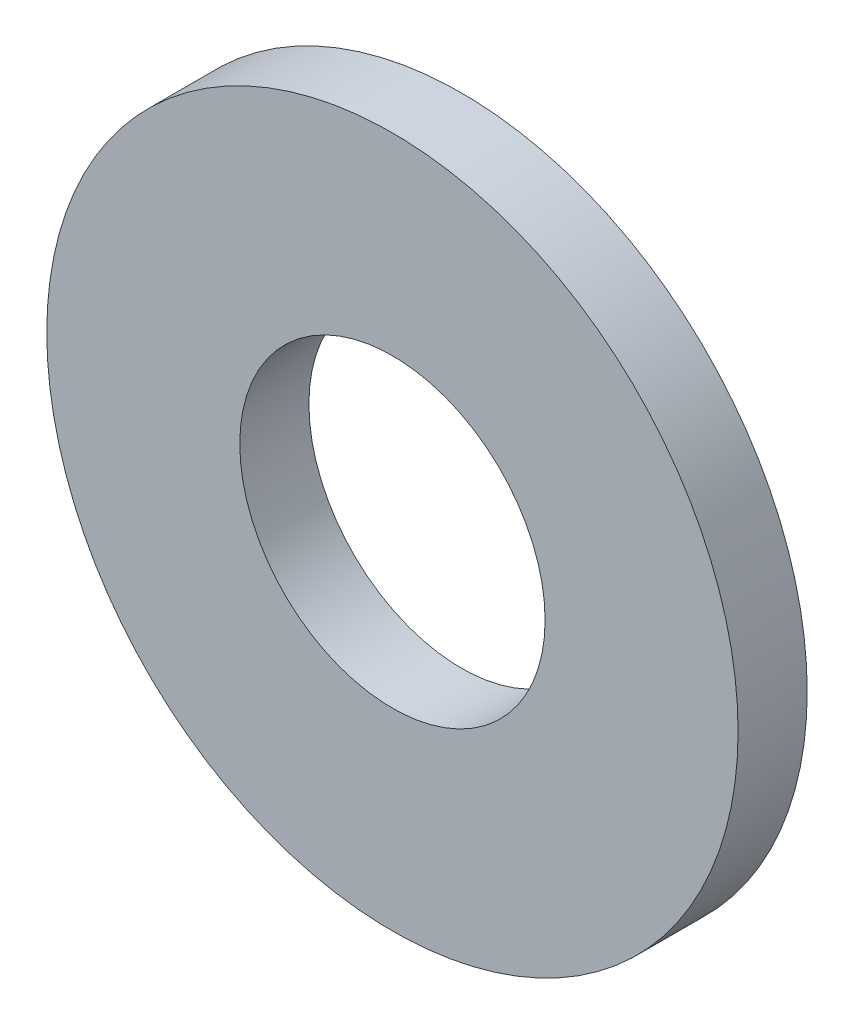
ISO-10303-21;
HEADER;
FILE_DESCRIPTION(('STEP AP214'),'2;1');
FILE_NAME('part.step','',(''),(''),'','','');
FILE_SCHEMA(('AUTOMOTIVE_DESIGN { 1 0 10303 214 1 1 1 1 }'));
ENDSEC;
DATA;
#1=APPLICATION_CONTEXT('core data for automotive mechanical design processes');
#2=APPLICATION_PROTOCOL_DEFINITION('international standard','automotive_design',2000,#1);
#3=PRODUCT_CONTEXT('',#1,'mechanical');
#4=PRODUCT('Part','Part','',(#3));
#5=PRODUCT_RELATED_PRODUCT_CATEGORY('part','',(#4));
#6=PRODUCT_DEFINITION_FORMATION('','',#4);
#7=PRODUCT_DEFINITION_CONTEXT('part definition',#1,'design');
#8=PRODUCT_DEFINITION('design','',#6,#7);
#9=PRODUCT_DEFINITION_SHAPE('','',#8);
#10=(LENGTH_UNIT() NAMED_UNIT(*) SI_UNIT(.MILLI.,.METRE.));
#11=(NAMED_UNIT(*) PLANE_ANGLE_UNIT() SI_UNIT($,.RADIAN.));
#12=(NAMED_UNIT(*) SI_UNIT($,.STERADIAN.) SOLID_ANGLE_UNIT());
#13=UNCERTAINTY_MEASURE_WITH_UNIT(LENGTH_MEASURE(1.E-05),#10,'distance_accuracy_value','');
#14=(GEOMETRIC_REPRESENTATION_CONTEXT(3) GLOBAL_UNCERTAINTY_ASSIGNED_CONTEXT((#13)) GLOBAL_UNIT_ASSIGNED_CONTEXT((#10,
#11,#12)) REPRESENTATION_CONTEXT('',''));
#15=CARTESIAN_POINT('',(0.,0.,0.));
#16=DIRECTION('',(0.,0.,1.));
#17=DIRECTION('',(1.,0.,0.));
#18=AXIS2_PLACEMENT_3D('',#15,#16,#17);
#19=CARTESIAN_POINT('',(0.,0.,1.2));
#20=DIRECTION('',(0.,0.,1.));
#21=DIRECTION('',(1.,0.,0.));
#22=AXIS2_PLACEMENT_3D('',#19,#20,#21);
#23=PLANE('',#22);
#24=CARTESIAN_POINT('',(0.,0.,1.2));
#25=DIRECTION('',(0.,0.,1.));
#26=DIRECTION('',(1.,0.,0.));
#27=AXIS2_PLACEMENT_3D('',#24,#25,#26);
#28=CIRCLE('',#27,2.65);
#29=CARTESIAN_POINT('',(2.65,0.,1.2));
#30=VERTEX_POINT('',#29);
#31=EDGE_CURVE('E46',#30,#30,#28,.F.);
#32=ORIENTED_EDGE('',*,*,#31,.T.);
#33=EDGE_LOOP('',(#32));
#34=FACE_BOUND('',#33,.T.);
#35=CARTESIAN_POINT('',(0.,0.,1.2));
#36=DIRECTION('',(0.,0.,1.));
#37=DIRECTION('',(1.,0.,0.));
#38=AXIS2_PLACEMENT_3D('',#35,#36,#37);
#39=CIRCLE('',#38,6.);
#40=CARTESIAN_POINT('',(6.,0.,1.2));
#41=VERTEX_POINT('',#40);
#42=EDGE_CURVE('E52',#41,#41,#39,.T.);
#43=ORIENTED_EDGE('',*,*,#42,.T.);
#44=EDGE_LOOP('',(#43));
#45=FACE_BOUND('',#44,.T.);
#46=ADVANCED_FACE('F39',(#34,#45),#23,.T.);
#47=CARTESIAN_POINT('',(0.,0.,0.));
#48=DIRECTION('',(0.,0.,1.));
#49=DIRECTION('',(1.,0.,0.));
#50=AXIS2_PLACEMENT_3D('',#47,#48,#49);
#51=PLANE('',#50);
#52=CARTESIAN_POINT('',(0.,0.,0.));
#53=DIRECTION('',(0.,0.,1.));
#54=DIRECTION('',(1.,0.,0.));
#55=AXIS2_PLACEMENT_3D('',#52,#53,#54);
#56=CIRCLE('',#55,2.65);
#57=CARTESIAN_POINT('',(2.65,0.,0.));
#58=VERTEX_POINT('',#57);
#59=EDGE_CURVE('E10',#58,#58,#56,.F.);
#60=ORIENTED_EDGE('',*,*,#59,.F.);
#61=EDGE_LOOP('',(#60));
#62=FACE_BOUND('',#61,.T.);
#63=CARTESIAN_POINT('',(0.,0.,0.));
#64=DIRECTION('',(0.,0.,1.));
#65=DIRECTION('',(1.,0.,0.));
#66=AXIS2_PLACEMENT_3D('',#63,#64,#65);
#67=CIRCLE('',#66,6.);
#68=CARTESIAN_POINT('',(6.,0.,0.));
#69=VERTEX_POINT('',#68);
#70=EDGE_CURVE('E42',#69,#69,#67,.T.);
#71=ORIENTED_EDGE('',*,*,#70,.F.);
#72=EDGE_LOOP('',(#71));
#73=FACE_BOUND('',#72,.T.);
#74=ADVANCED_FACE('F61',(#62,#73),#51,.F.);
#75=CARTESIAN_POINT('',(0.,0.,1.2));
#76=DIRECTION('',(0.,0.,1.));
#77=DIRECTION('',(1.,0.,0.));
#78=AXIS2_PLACEMENT_3D('',#75,#76,#77);
#79=CYLINDRICAL_SURFACE('',#78,2.65);
#80=ORIENTED_EDGE('',*,*,#59,.T.);
#81=EDGE_LOOP('',(#80));
#82=FACE_BOUND('',#81,.T.);
#83=ORIENTED_EDGE('',*,*,#31,.F.);
#84=EDGE_LOOP('',(#83));
#85=FACE_BOUND('',#84,.T.);
#86=ADVANCED_FACE('F63',(#82,#85),#79,.F.);
#87=CARTESIAN_POINT('',(0.,0.,-8.8));
#88=DIRECTION('',(0.,0.,1.));
#89=DIRECTION('',(1.,0.,0.));
#90=AXIS2_PLACEMENT_3D('',#87,#88,#89);
#91=CYLINDRICAL_SURFACE('',#90,6.);
#92=ORIENTED_EDGE('',*,*,#42,.F.);
#93=EDGE_LOOP('',(#92));
#94=FACE_BOUND('',#93,.T.);
#95=ORIENTED_EDGE('',*,*,#70,.T.);
#96=EDGE_LOOP('',(#95));
#97=FACE_BOUND('',#96,.T.);
#98=ADVANCED_FACE('F59',(#94,#97),#91,.T.);
#99=CLOSED_SHELL('',(#46,#74,#86,#98));
#100=MANIFOLD_SOLID_BREP('B2',#99);
#101=ADVANCED_BREP_SHAPE_REPRESENTATION('',(#18,#100),#14);
#102=SHAPE_DEFINITION_REPRESENTATION(#9,#101);
ENDSEC;
END-ISO-10303-21;
